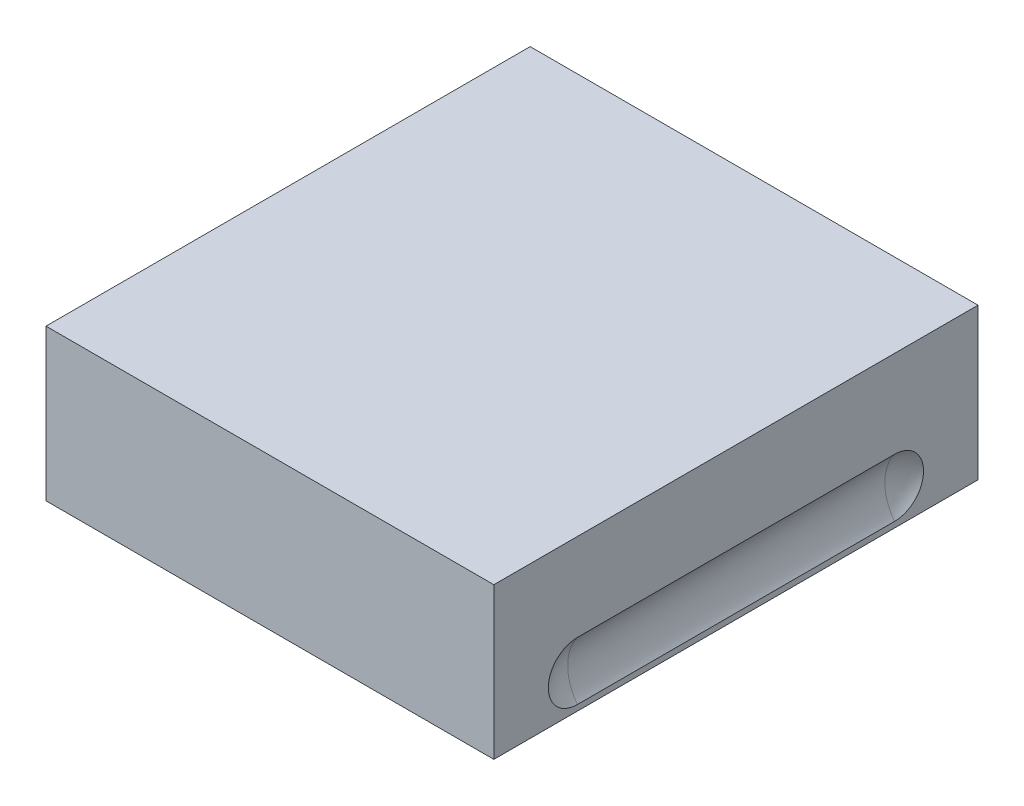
ISO-10303-21;
HEADER;
FILE_DESCRIPTION(('STEP AP214'),'2;1');
FILE_NAME('part.step','',(''),(''),'','','');
FILE_SCHEMA(('AUTOMOTIVE_DESIGN { 1 0 10303 214 1 1 1 1 }'));
ENDSEC;
DATA;
#1=APPLICATION_CONTEXT('core data for automotive mechanical design processes');
#2=APPLICATION_PROTOCOL_DEFINITION('international standard','automotive_design',2000,#1);
#3=PRODUCT_CONTEXT('',#1,'mechanical');
#4=PRODUCT('Part','Part','',(#3));
#5=PRODUCT_RELATED_PRODUCT_CATEGORY('part','',(#4));
#6=PRODUCT_DEFINITION_FORMATION('','',#4);
#7=PRODUCT_DEFINITION_CONTEXT('part definition',#1,'design');
#8=PRODUCT_DEFINITION('design','',#6,#7);
#9=PRODUCT_DEFINITION_SHAPE('','',#8);
#10=(LENGTH_UNIT() NAMED_UNIT(*) SI_UNIT(.MILLI.,.METRE.));
#11=(NAMED_UNIT(*) PLANE_ANGLE_UNIT() SI_UNIT($,.RADIAN.));
#12=(NAMED_UNIT(*) SI_UNIT($,.STERADIAN.) SOLID_ANGLE_UNIT());
#13=UNCERTAINTY_MEASURE_WITH_UNIT(LENGTH_MEASURE(1.E-05),#10,'distance_accuracy_value','');
#14=(GEOMETRIC_REPRESENTATION_CONTEXT(3) GLOBAL_UNCERTAINTY_ASSIGNED_CONTEXT((#13)) GLOBAL_UNIT_ASSIGNED_CONTEXT((#10,
#11,#12)) REPRESENTATION_CONTEXT('',''));
#15=CARTESIAN_POINT('',(0.,0.,0.));
#16=DIRECTION('',(0.,0.,1.));
#17=DIRECTION('',(1.,0.,0.));
#18=AXIS2_PLACEMENT_3D('',#15,#16,#17);
#19=CARTESIAN_POINT('',(0.,82.,-155.));
#20=DIRECTION('',(0.,1.,0.));
#21=DIRECTION('',(0.,0.,1.));
#22=AXIS2_PLACEMENT_3D('',#19,#20,#21);
#23=PLANE('',#22);
#24=DIRECTION('',(1.,0.,0.));
#25=VECTOR('',#24,1.);
#26=CARTESIAN_POINT('',(23.5,82.,-114.));
#27=LINE('',#26,#25);
#28=CARTESIAN_POINT('',(23.5,82.,-114.));
#29=VERTEX_POINT('',#28);
#30=CARTESIAN_POINT('',(-23.5,82.,-114.));
#31=VERTEX_POINT('',#30);
#32=EDGE_CURVE('E272',#29,#31,#27,.F.);
#33=ORIENTED_EDGE('',*,*,#32,.T.);
#34=DIRECTION('',(0.,0.,1.));
#35=VECTOR('',#34,1.);
#36=CARTESIAN_POINT('',(-23.5,82.,-114.));
#37=LINE('',#36,#35);
#38=CARTESIAN_POINT('',(-23.5,82.,-196.));
#39=VERTEX_POINT('',#38);
#40=EDGE_CURVE('E271',#31,#39,#37,.F.);
#41=ORIENTED_EDGE('',*,*,#40,.T.);
#42=DIRECTION('',(-1.,0.,0.));
#43=VECTOR('',#42,1.);
#44=CARTESIAN_POINT('',(-23.5,82.,-196.));
#45=LINE('',#44,#43);
#46=CARTESIAN_POINT('',(23.5,82.,-196.));
#47=VERTEX_POINT('',#46);
#48=EDGE_CURVE('E279',#39,#47,#45,.F.);
#49=ORIENTED_EDGE('',*,*,#48,.T.);
#50=DIRECTION('',(0.,0.,-1.));
#51=VECTOR('',#50,1.);
#52=CARTESIAN_POINT('',(23.5,82.,-196.));
#53=LINE('',#52,#51);
#54=EDGE_CURVE('E80',#47,#29,#53,.F.);
#55=ORIENTED_EDGE('',*,*,#54,.T.);
#56=EDGE_LOOP('',(#33,#41,#49,#55));
#57=FACE_BOUND('',#56,.T.);
#58=ADVANCED_FACE('F14',(#57),#23,.F.);
#59=CARTESIAN_POINT('',(23.5,70.,-114.));
#60=DIRECTION('',(0.,0.,1.));
#61=DIRECTION('',(1.,0.,0.));
#62=AXIS2_PLACEMENT_3D('',#59,#60,#61);
#63=PLANE('',#62);
#64=DIRECTION('',(0.,1.,0.));
#65=VECTOR('',#64,1.);
#66=CARTESIAN_POINT('',(23.5,70.,-114.));
#67=LINE('',#66,#65);
#68=CARTESIAN_POINT('',(23.5,70.,-114.));
#69=VERTEX_POINT('',#68);
#70=EDGE_CURVE('E250',#29,#69,#67,.F.);
#71=ORIENTED_EDGE('',*,*,#70,.T.);
#72=DIRECTION('',(1.,0.,0.));
#73=VECTOR('',#72,1.);
#74=CARTESIAN_POINT('',(0.,70.,-114.));
#75=LINE('',#74,#73);
#76=CARTESIAN_POINT('',(-23.5,70.,-114.));
#77=VERTEX_POINT('',#76);
#78=EDGE_CURVE('E218',#69,#77,#75,.F.);
#79=ORIENTED_EDGE('',*,*,#78,.T.);
#80=DIRECTION('',(0.,1.,0.));
#81=VECTOR('',#80,1.);
#82=CARTESIAN_POINT('',(-23.5,70.,-114.));
#83=LINE('',#82,#81);
#84=EDGE_CURVE('E263',#77,#31,#83,.T.);
#85=ORIENTED_EDGE('',*,*,#84,.T.);
#86=ORIENTED_EDGE('',*,*,#32,.F.);
#87=EDGE_LOOP('',(#71,#79,#85,#86));
#88=FACE_BOUND('',#87,.T.);
#89=ADVANCED_FACE('F260',(#88),#63,.F.);
#90=CARTESIAN_POINT('',(-23.5,70.,-114.));
#91=DIRECTION('',(-1.,0.,0.));
#92=DIRECTION('',(0.,0.,1.));
#93=AXIS2_PLACEMENT_3D('',#90,#91,#92);
#94=PLANE('',#93);
#95=ORIENTED_EDGE('',*,*,#84,.F.);
#96=DIRECTION('',(0.,0.,1.));
#97=VECTOR('',#96,1.);
#98=CARTESIAN_POINT('',(-23.5,70.,-155.));
#99=LINE('',#98,#97);
#100=CARTESIAN_POINT('',(-23.5,70.,-196.));
#101=VERTEX_POINT('',#100);
#102=EDGE_CURVE('E221',#77,#101,#99,.F.);
#103=ORIENTED_EDGE('',*,*,#102,.T.);
#104=DIRECTION('',(0.,1.,0.));
#105=VECTOR('',#104,1.);
#106=CARTESIAN_POINT('',(-23.5,70.,-196.));
#107=LINE('',#106,#105);
#108=EDGE_CURVE('E274',#101,#39,#107,.T.);
#109=ORIENTED_EDGE('',*,*,#108,.T.);
#110=ORIENTED_EDGE('',*,*,#40,.F.);
#111=EDGE_LOOP('',(#95,#103,#109,#110));
#112=FACE_BOUND('',#111,.T.);
#113=ADVANCED_FACE('F268',(#112),#94,.F.);
#114=CARTESIAN_POINT('',(-23.5,70.,-196.));
#115=DIRECTION('',(0.,0.,-1.));
#116=DIRECTION('',(-1.,0.,0.));
#117=AXIS2_PLACEMENT_3D('',#114,#115,#116);
#118=PLANE('',#117);
#119=ORIENTED_EDGE('',*,*,#108,.F.);
#120=DIRECTION('',(1.,0.,0.));
#121=VECTOR('',#120,1.);
#122=CARTESIAN_POINT('',(0.,70.,-196.));
#123=LINE('',#122,#121);
#124=CARTESIAN_POINT('',(23.5,70.,-196.));
#125=VERTEX_POINT('',#124);
#126=EDGE_CURVE('E233',#101,#125,#123,.T.);
#127=ORIENTED_EDGE('',*,*,#126,.T.);
#128=DIRECTION('',(0.,1.,0.));
#129=VECTOR('',#128,1.);
#130=CARTESIAN_POINT('',(23.5,70.,-196.));
#131=LINE('',#130,#129);
#132=EDGE_CURVE('E251',#125,#47,#131,.T.);
#133=ORIENTED_EDGE('',*,*,#132,.T.);
#134=ORIENTED_EDGE('',*,*,#48,.F.);
#135=EDGE_LOOP('',(#119,#127,#133,#134));
#136=FACE_BOUND('',#135,.T.);
#137=ADVANCED_FACE('F288',(#136),#118,.F.);
#138=CARTESIAN_POINT('',(23.5,70.,-196.));
#139=DIRECTION('',(1.,0.,0.));
#140=DIRECTION('',(0.,0.,-1.));
#141=AXIS2_PLACEMENT_3D('',#138,#139,#140);
#142=PLANE('',#141);
#143=ORIENTED_EDGE('',*,*,#132,.F.);
#144=DIRECTION('',(0.,0.,1.));
#145=VECTOR('',#144,1.);
#146=CARTESIAN_POINT('',(23.5,70.,-155.));
#147=LINE('',#146,#145);
#148=EDGE_CURVE('E93',#125,#69,#147,.T.);
#149=ORIENTED_EDGE('',*,*,#148,.T.);
#150=ORIENTED_EDGE('',*,*,#70,.F.);
#151=ORIENTED_EDGE('',*,*,#54,.F.);
#152=EDGE_LOOP('',(#143,#149,#150,#151));
#153=FACE_BOUND('',#152,.T.);
#154=ADVANCED_FACE('F246',(#153),#142,.F.);
#155=CARTESIAN_POINT('',(86.8,81.5,-102.6));
#156=DIRECTION('',(0.319232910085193,0.363109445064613,0.875352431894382));
#157=DIRECTION('',(0.68200630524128,-0.729362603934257,0.053829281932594));
#158=AXIS2_PLACEMENT_3D('',#155,#156,#157);
#159=SPHERICAL_SURFACE('',#158,16.);
#160=CARTESIAN_POINT('',(86.8,81.5,-102.6));
#161=DIRECTION('',(0.,0.,1.));
#162=DIRECTION('',(1.,0.,0.));
#163=AXIS2_PLACEMENT_3D('',#160,#161,#162);
#164=CIRCLE('',#163,16.);
#165=CARTESIAN_POINT('',(74.,71.9,-102.6));
#166=VERTEX_POINT('',#165);
#167=CARTESIAN_POINT('',(74.,91.1,-102.6));
#168=VERTEX_POINT('',#167);
#169=EDGE_CURVE('E18',#166,#168,#164,.F.);
#170=ORIENTED_EDGE('',*,*,#169,.T.);
#171=CARTESIAN_POINT('',(74.,71.9000000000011,-102.6));
#172=CARTESIAN_POINT('',(74.,71.8999709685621,-102.329996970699));
#173=CARTESIAN_POINT('',(74.,71.9113896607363,-102.059998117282));
#174=CARTESIAN_POINT('',(74.,71.9569128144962,-101.52193206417));
#175=CARTESIAN_POINT('',(74.,71.9910161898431,-101.253864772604));
#176=CARTESIAN_POINT('',(74.,72.0816671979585,-100.721746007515));
#177=CARTESIAN_POINT('',(74.,72.1381990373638,-100.457691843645));
#178=CARTESIAN_POINT('',(74.,72.2732956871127,-99.9352849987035));
#179=CARTESIAN_POINT('',(74.,72.35186022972,-99.6769322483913));
#180=CARTESIAN_POINT('',(74.,72.5305080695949,-99.1676431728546));
#181=CARTESIAN_POINT('',(74.,72.6306012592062,-98.9167103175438));
#182=CARTESIAN_POINT('',(74.,72.8515750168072,-98.4241642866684));
#183=CARTESIAN_POINT('',(74.,72.9724560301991,-98.1825513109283));
#184=CARTESIAN_POINT('',(74.,73.2341176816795,-97.7104172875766));
#185=CARTESIAN_POINT('',(74.,73.3748942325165,-97.4798939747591));
#186=CARTESIAN_POINT('',(74.,73.6753642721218,-97.0315258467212));
#187=CARTESIAN_POINT('',(74.,73.8350576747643,-96.8136809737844));
#188=CARTESIAN_POINT('',(74.,74.1722327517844,-96.3922096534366));
#189=CARTESIAN_POINT('',(74.,74.3497150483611,-96.1885837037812));
#190=CARTESIAN_POINT('',(74.,74.7211976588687,-95.7970102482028));
#191=CARTESIAN_POINT('',(74.,74.9151976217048,-95.6090624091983));
#192=CARTESIAN_POINT('',(74.,75.3183728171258,-95.2501469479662));
#193=CARTESIAN_POINT('',(74.,75.5275505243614,-95.0791821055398));
#194=CARTESIAN_POINT('',(74.,75.9595657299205,-94.7554832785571));
#195=CARTESIAN_POINT('',(74.,76.1824032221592,-94.6027492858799));
#196=CARTESIAN_POINT('',(74.,76.6401435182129,-94.31660437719));
#197=CARTESIAN_POINT('',(74.,76.875045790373,-94.1831926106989));
#198=CARTESIAN_POINT('',(74.,77.3552545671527,-93.9366326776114));
#199=CARTESIAN_POINT('',(74.,77.6005610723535,-93.8234845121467));
#200=CARTESIAN_POINT('',(74.,78.0998181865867,-93.6182628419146));
#201=CARTESIAN_POINT('',(74.,78.3537682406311,-93.5261879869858));
#202=CARTESIAN_POINT('',(74.,78.8685220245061,-93.3637582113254));
#203=CARTESIAN_POINT('',(74.,79.1293257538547,-93.2934032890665));
#204=CARTESIAN_POINT('',(74.,79.6559382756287,-93.1749123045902));
#205=CARTESIAN_POINT('',(74.,79.9217471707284,-93.1267766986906));
#206=CARTESIAN_POINT('',(74.,80.4564751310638,-93.0530686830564));
#207=CARTESIAN_POINT('',(74.,80.7253941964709,-93.0274962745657));
#208=CARTESIAN_POINT('',(74.,81.2644368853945,-92.9990961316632));
#209=CARTESIAN_POINT('',(74.,81.5345605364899,-92.9962689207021));
#210=CARTESIAN_POINT('',(74.,82.0740857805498,-93.0133806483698));
#211=CARTESIAN_POINT('',(74.,82.3434873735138,-93.0333195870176));
#212=CARTESIAN_POINT('',(74.,82.8796505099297,-93.0958215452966));
#213=CARTESIAN_POINT('',(74.,83.1464120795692,-93.1383843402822));
#214=CARTESIAN_POINT('',(74.,83.6754013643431,-93.2458312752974));
#215=CARTESIAN_POINT('',(74.,83.9376290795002,-93.3107154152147));
#216=CARTESIAN_POINT('',(74.,84.4556855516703,-93.4623435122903));
#217=CARTESIAN_POINT('',(74.,84.7115143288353,-93.5490874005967));
#218=CARTESIAN_POINT('',(74.,85.214954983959,-93.7438183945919));
#219=CARTESIAN_POINT('',(74.,85.4625668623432,-93.8518054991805));
#220=CARTESIAN_POINT('',(74.,85.947819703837,-94.0882582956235));
#221=CARTESIAN_POINT('',(74.,86.1854604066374,-94.2167245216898));
#222=CARTESIAN_POINT('',(74.,86.6490745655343,-94.4932202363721));
#223=CARTESIAN_POINT('',(74.,86.8750480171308,-94.6412497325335));
#224=CARTESIAN_POINT('',(74.,87.3137102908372,-94.9558118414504));
#225=CARTESIAN_POINT('',(74.,87.5263997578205,-95.1223435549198));
#226=CARTESIAN_POINT('',(74.,87.9369936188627,-95.4727317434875));
#227=CARTESIAN_POINT('',(74.,88.1348980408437,-95.6565881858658));
#228=CARTESIAN_POINT('',(74.,88.5144879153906,-96.0402913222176));
#229=CARTESIAN_POINT('',(74.,88.6961757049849,-96.240135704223));
#230=CARTESIAN_POINT('',(74.,89.0420768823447,-96.6544219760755));
#231=CARTESIAN_POINT('',(74.,89.2062898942,-96.8688641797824));
#232=CARTESIAN_POINT('',(74.,89.5161199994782,-97.3108895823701));
#233=CARTESIAN_POINT('',(74.,89.6617310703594,-97.5384770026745));
#234=CARTESIAN_POINT('',(74.,89.9332554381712,-98.0051042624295));
#235=CARTESIAN_POINT('',(74.,90.0591693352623,-98.2441437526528));
#236=CARTESIAN_POINT('',(74.,90.2904830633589,-98.7321367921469));
#237=CARTESIAN_POINT('',(74.,90.3958697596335,-98.9810965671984));
#238=CARTESIAN_POINT('',(74.,90.585276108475,-99.4870096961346));
#239=CARTESIAN_POINT('',(74.,90.6692963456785,-99.7439628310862));
#240=CARTESIAN_POINT('',(74.,90.8152815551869,-100.263698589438));
#241=CARTESIAN_POINT('',(74.,90.8772745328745,-100.526473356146));
#242=CARTESIAN_POINT('',(74.,90.9788912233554,-101.056205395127));
#243=CARTESIAN_POINT('',(74.,91.0185259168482,-101.323160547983));
#244=CARTESIAN_POINT('',(74.,91.0645706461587,-101.758913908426));
#245=CARTESIAN_POINT('',(74.,91.0778651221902,-101.927014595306));
#246=CARTESIAN_POINT('',(74.,91.0955734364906,-102.263404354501));
#247=CARTESIAN_POINT('',(74.,91.100001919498,-102.43169265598));
#248=CARTESIAN_POINT('',(74.,91.0999999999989,-102.6));
#249=B_SPLINE_CURVE_WITH_KNOTS('',3,(#171,#172,#173,#174,#175,#176,#177,#178,#179,#180,#181,
#182,#183,#184,#185,#186,#187,#188,#189,#190,#191,#192,#193,#194,#195,#196,#197,#198,#199,#200,
#201,#202,#203,#204,#205,#206,#207,#208,#209,#210,#211,#212,#213,#214,#215,#216,#217,#218,#219,
#220,#221,#222,#223,#224,#225,#226,#227,#228,#229,#230,#231,#232,#233,#234,#235,#236,#237,#238,
#239,#240,#241,#242,#243,#244,#245,#246,#247,#248),.UNSPECIFIED.,.F.,.F.,(4,2,2,2,2,2,2,2,2,2,2,
2,2,2,2,2,2,2,2,2,2,2,2,2,2,2,2,2,2,2,2,2,2,2,2,2,2,2,4),(0.,0.809761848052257,1.61948492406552,
2.42863882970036,3.23778290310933,4.04729957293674,4.85683358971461,5.66620154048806,
6.47556580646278,7.28495839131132,8.09433377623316,8.90384142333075,9.71334870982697,
10.5228203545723,11.3322920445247,12.1417118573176,12.9511316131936,13.7605679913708,
14.5700044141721,15.3794594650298,16.188914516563,16.9983615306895,17.8078085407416,
18.6172530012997,19.4266974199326,20.2361629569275,21.0456288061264,21.8550553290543,
22.6644803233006,23.4737884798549,24.2831140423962,25.0927009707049,25.902263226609,
26.7123418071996,27.5223982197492,28.3314210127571,29.1400461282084,29.6457079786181,
30.1505338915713),.UNSPECIFIED.);
#250=EDGE_CURVE('E77',#166,#168,#249,.T.);
#251=ORIENTED_EDGE('',*,*,#250,.F.);
#252=EDGE_LOOP('',(#170,#251));
#253=FACE_BOUND('',#252,.T.);
#254=ADVANCED_FACE('F75',(#253),#159,.F.);
#255=CARTESIAN_POINT('',(86.8,81.5,-155.));
#256=DIRECTION('',(0.,0.,1.));
#257=DIRECTION('',(1.,0.,0.));
#258=AXIS2_PLACEMENT_3D('',#255,#256,#257);
#259=CYLINDRICAL_SURFACE('',#258,16.);
#260=ORIENTED_EDGE('',*,*,#169,.F.);
#261=DIRECTION('',(0.,0.,-1.));
#262=VECTOR('',#261,1.);
#263=CARTESIAN_POINT('',(74.,71.9,-235.));
#264=LINE('',#263,#262);
#265=CARTESIAN_POINT('',(74.,71.9,-207.4));
#266=VERTEX_POINT('',#265);
#267=EDGE_CURVE('E91',#266,#166,#264,.F.);
#268=ORIENTED_EDGE('',*,*,#267,.F.);
#269=CARTESIAN_POINT('',(86.8,81.5,-207.4));
#270=DIRECTION('',(0.,0.,1.));
#271=DIRECTION('',(1.,0.,0.));
#272=AXIS2_PLACEMENT_3D('',#269,#270,#271);
#273=CIRCLE('',#272,16.);
#274=CARTESIAN_POINT('',(74.,91.1,-207.4));
#275=VERTEX_POINT('',#274);
#276=EDGE_CURVE('E79',#266,#275,#273,.F.);
#277=ORIENTED_EDGE('',*,*,#276,.T.);
#278=DIRECTION('',(0.,0.,-1.));
#279=VECTOR('',#278,1.);
#280=CARTESIAN_POINT('',(74.,91.1,-235.));
#281=LINE('',#280,#279);
#282=EDGE_CURVE('E82',#168,#275,#281,.T.);
#283=ORIENTED_EDGE('',*,*,#282,.F.);
#284=EDGE_LOOP('',(#260,#268,#277,#283));
#285=FACE_BOUND('',#284,.T.);
#286=ADVANCED_FACE('F83',(#285),#259,.F.);
#287=CARTESIAN_POINT('',(86.8,81.5,-207.4));
#288=DIRECTION('',(0.319232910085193,0.363109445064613,0.875352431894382));
#289=DIRECTION('',(0.68200630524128,-0.729362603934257,0.053829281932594));
#290=AXIS2_PLACEMENT_3D('',#287,#288,#289);
#291=SPHERICAL_SURFACE('',#290,16.);
#292=ORIENTED_EDGE('',*,*,#276,.F.);
#293=CARTESIAN_POINT('',(74.,91.0999999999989,-207.4));
#294=CARTESIAN_POINT('',(74.,91.1000290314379,-207.670003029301));
#295=CARTESIAN_POINT('',(74.,91.0886103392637,-207.940001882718));
#296=CARTESIAN_POINT('',(74.,91.0430871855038,-208.47806793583));
#297=CARTESIAN_POINT('',(74.,91.0089838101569,-208.746135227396));
#298=CARTESIAN_POINT('',(74.,90.9183328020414,-209.278253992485));
#299=CARTESIAN_POINT('',(74.,90.8618009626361,-209.542308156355));
#300=CARTESIAN_POINT('',(74.,90.7267043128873,-210.064715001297));
#301=CARTESIAN_POINT('',(74.,90.64813977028,-210.323067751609));
#302=CARTESIAN_POINT('',(74.,90.4694919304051,-210.832356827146));
#303=CARTESIAN_POINT('',(74.,90.3693987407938,-211.083289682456));
#304=CARTESIAN_POINT('',(74.,90.1484249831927,-211.575835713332));
#305=CARTESIAN_POINT('',(74.,90.0275439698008,-211.817448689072));
#306=CARTESIAN_POINT('',(74.,89.7658823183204,-212.289582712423));
#307=CARTESIAN_POINT('',(74.,89.6251057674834,-212.520106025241));
#308=CARTESIAN_POINT('',(74.,89.3246357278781,-212.968474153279));
#309=CARTESIAN_POINT('',(74.,89.1649423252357,-213.186319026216));
#310=CARTESIAN_POINT('',(74.,88.8277672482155,-213.607790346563));
#311=CARTESIAN_POINT('',(74.,88.6502849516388,-213.811416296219));
#312=CARTESIAN_POINT('',(74.,88.2788023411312,-214.202989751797));
#313=CARTESIAN_POINT('',(74.,88.0848023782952,-214.390937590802));
#314=CARTESIAN_POINT('',(74.,87.6816271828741,-214.749853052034));
#315=CARTESIAN_POINT('',(74.,87.4724494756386,-214.92081789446));
#316=CARTESIAN_POINT('',(74.,87.0404342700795,-215.244516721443));
#317=CARTESIAN_POINT('',(74.,86.8175967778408,-215.39725071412));
#318=CARTESIAN_POINT('',(74.,86.3598564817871,-215.68339562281));
#319=CARTESIAN_POINT('',(74.,86.124954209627,-215.816807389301));
#320=CARTESIAN_POINT('',(74.,85.6447454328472,-216.063367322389));
#321=CARTESIAN_POINT('',(74.,85.3994389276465,-216.176515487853));
#322=CARTESIAN_POINT('',(74.,84.9001818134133,-216.381737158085));
#323=CARTESIAN_POINT('',(74.,84.6462317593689,-216.473812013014));
#324=CARTESIAN_POINT('',(74.,84.1314779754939,-216.636241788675));
#325=CARTESIAN_POINT('',(74.,83.8706742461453,-216.706596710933));
#326=CARTESIAN_POINT('',(74.,83.3440617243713,-216.82508769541));
#327=CARTESIAN_POINT('',(74.,83.0782528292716,-216.873223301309));
#328=CARTESIAN_POINT('',(74.,82.5435248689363,-216.946931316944));
#329=CARTESIAN_POINT('',(74.,82.2746058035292,-216.972503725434));
#330=CARTESIAN_POINT('',(74.,81.7355631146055,-217.000903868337));
#331=CARTESIAN_POINT('',(74.,81.4654394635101,-217.003731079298));
#332=CARTESIAN_POINT('',(74.,80.9259142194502,-216.98661935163));
#333=CARTESIAN_POINT('',(74.,80.6565126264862,-216.966680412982));
#334=CARTESIAN_POINT('',(74.,80.1203494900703,-216.904178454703));
#335=CARTESIAN_POINT('',(74.,79.8535879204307,-216.861615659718));
#336=CARTESIAN_POINT('',(74.,79.3245986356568,-216.754168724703));
#337=CARTESIAN_POINT('',(74.,79.0623709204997,-216.689284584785));
#338=CARTESIAN_POINT('',(74.,78.5443144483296,-216.53765648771));
#339=CARTESIAN_POINT('',(74.,78.2884856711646,-216.450912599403));
#340=CARTESIAN_POINT('',(74.,77.785045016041,-216.256181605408));
#341=CARTESIAN_POINT('',(74.,77.5374331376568,-216.148194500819));
#342=CARTESIAN_POINT('',(74.,77.052180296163,-215.911741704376));
#343=CARTESIAN_POINT('',(74.,76.8145395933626,-215.78327547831));
#344=CARTESIAN_POINT('',(74.,76.3509254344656,-215.506779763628));
#345=CARTESIAN_POINT('',(74.,76.1249519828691,-215.358750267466));
#346=CARTESIAN_POINT('',(74.,75.6862897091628,-215.04418815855));
#347=CARTESIAN_POINT('',(74.,75.4736002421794,-214.87765644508));
#348=CARTESIAN_POINT('',(74.,75.0630063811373,-214.527268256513));
#349=CARTESIAN_POINT('',(74.,74.8651019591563,-214.343411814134));
#350=CARTESIAN_POINT('',(74.,74.4855120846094,-213.959708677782));
#351=CARTESIAN_POINT('',(74.,74.3038242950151,-213.759864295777));
#352=CARTESIAN_POINT('',(74.,73.9579231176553,-213.345578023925));
#353=CARTESIAN_POINT('',(74.,73.7937101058,-213.131135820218));
#354=CARTESIAN_POINT('',(74.,73.4838800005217,-212.68911041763));
#355=CARTESIAN_POINT('',(74.,73.3382689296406,-212.461522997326));
#356=CARTESIAN_POINT('',(74.,73.0667445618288,-211.994895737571));
#357=CARTESIAN_POINT('',(74.,72.9408306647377,-211.755856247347));
#358=CARTESIAN_POINT('',(74.,72.709516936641,-211.267863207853));
#359=CARTESIAN_POINT('',(74.,72.6041302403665,-211.018903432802));
#360=CARTESIAN_POINT('',(74.,72.414723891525,-210.512990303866));
#361=CARTESIAN_POINT('',(74.,72.3307036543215,-210.256037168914));
#362=CARTESIAN_POINT('',(74.,72.1847184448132,-209.736301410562));
#363=CARTESIAN_POINT('',(74.,72.1227254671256,-209.473526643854));
#364=CARTESIAN_POINT('',(74.,72.0211087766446,-208.943794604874));
#365=CARTESIAN_POINT('',(74.,71.9814740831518,-208.676839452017));
#366=CARTESIAN_POINT('',(74.,71.9354293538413,-208.241086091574));
#367=CARTESIAN_POINT('',(74.,71.9221348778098,-208.072985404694));
#368=CARTESIAN_POINT('',(74.,71.9044265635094,-207.736595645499));
#369=CARTESIAN_POINT('',(74.,71.899998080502,-207.56830734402));
#370=CARTESIAN_POINT('',(74.,71.9000000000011,-207.4));
#371=B_SPLINE_CURVE_WITH_KNOTS('',3,(#293,#294,#295,#296,#297,#298,#299,#300,#301,#302,#303,
#304,#305,#306,#307,#308,#309,#310,#311,#312,#313,#314,#315,#316,#317,#318,#319,#320,#321,#322,
#323,#324,#325,#326,#327,#328,#329,#330,#331,#332,#333,#334,#335,#336,#337,#338,#339,#340,#341,
#342,#343,#344,#345,#346,#347,#348,#349,#350,#351,#352,#353,#354,#355,#356,#357,#358,#359,#360,
#361,#362,#363,#364,#365,#366,#367,#368,#369,#370),.UNSPECIFIED.,.F.,.F.,(4,2,2,2,2,2,2,2,2,2,2,
2,2,2,2,2,2,2,2,2,2,2,2,2,2,2,2,2,2,2,2,2,2,2,2,2,2,2,4),(0.,0.809761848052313,1.61948492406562,
2.42863882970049,3.23778290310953,4.04729957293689,4.85683358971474,5.66620154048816,
6.47556580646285,7.2849583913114,8.09433377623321,8.90384142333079,9.71334870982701,
10.5228203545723,11.3322920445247,12.1417118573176,12.9511316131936,13.7605679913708,
14.570004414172,15.3794594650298,16.188914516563,16.9983615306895,17.8078085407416,
18.6172530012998,19.4266974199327,20.2361629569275,21.0456288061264,21.8550553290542,
22.6644803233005,23.4737884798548,24.2831140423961,25.0927009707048,25.9022632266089,
26.7123418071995,27.5223982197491,28.331421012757,29.1400461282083,29.645707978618,
30.1505338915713),.UNSPECIFIED.);
#372=EDGE_CURVE('E88',#275,#266,#371,.T.);
#373=ORIENTED_EDGE('',*,*,#372,.F.);
#374=EDGE_LOOP('',(#292,#373));
#375=FACE_BOUND('',#374,.T.);
#376=ADVANCED_FACE('F154',(#375),#291,.F.);
#377=CARTESIAN_POINT('',(-86.8,81.5,-207.4));
#378=DIRECTION('',(0.319232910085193,0.363109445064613,0.875352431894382));
#379=DIRECTION('',(0.68200630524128,-0.729362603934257,0.053829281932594));
#380=AXIS2_PLACEMENT_3D('',#377,#378,#379);
#381=SPHERICAL_SURFACE('',#380,16.);
#382=CARTESIAN_POINT('',(-86.8,81.5,-207.4));
#383=DIRECTION('',(0.,0.,-1.));
#384=DIRECTION('',(-1.,0.,0.));
#385=AXIS2_PLACEMENT_3D('',#382,#383,#384);
#386=CIRCLE('',#385,16.);
#387=CARTESIAN_POINT('',(-74.,71.9,-207.4));
#388=VERTEX_POINT('',#387);
#389=CARTESIAN_POINT('',(-74.,91.1,-207.4));
#390=VERTEX_POINT('',#389);
#391=EDGE_CURVE('E219',#388,#390,#386,.F.);
#392=ORIENTED_EDGE('',*,*,#391,.T.);
#393=CARTESIAN_POINT('',(-74.,71.9000000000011,-207.4));
#394=CARTESIAN_POINT('',(-74.,71.8999709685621,-207.670003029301));
#395=CARTESIAN_POINT('',(-74.,71.9113896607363,-207.940001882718));
#396=CARTESIAN_POINT('',(-74.,71.9569128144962,-208.47806793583));
#397=CARTESIAN_POINT('',(-74.,71.9910161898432,-208.746135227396));
#398=CARTESIAN_POINT('',(-74.,72.0816671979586,-209.278253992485));
#399=CARTESIAN_POINT('',(-74.,72.1381990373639,-209.542308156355));
#400=CARTESIAN_POINT('',(-74.,72.2732956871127,-210.064715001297));
#401=CARTESIAN_POINT('',(-74.,72.35186022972,-210.323067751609));
#402=CARTESIAN_POINT('',(-74.,72.5305080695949,-210.832356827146));
#403=CARTESIAN_POINT('',(-74.,72.6306012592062,-211.083289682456));
#404=CARTESIAN_POINT('',(-74.,72.8515750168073,-211.575835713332));
#405=CARTESIAN_POINT('',(-74.,72.9724560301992,-211.817448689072));
#406=CARTESIAN_POINT('',(-74.,73.2341176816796,-212.289582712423));
#407=CARTESIAN_POINT('',(-74.,73.3748942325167,-212.520106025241));
#408=CARTESIAN_POINT('',(-74.,73.6753642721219,-212.968474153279));
#409=CARTESIAN_POINT('',(-74.,73.8350576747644,-213.186319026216));
#410=CARTESIAN_POINT('',(-74.,74.1722327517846,-213.607790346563));
#411=CARTESIAN_POINT('',(-74.,74.3497150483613,-213.811416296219));
#412=CARTESIAN_POINT('',(-74.,74.7211976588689,-214.202989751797));
#413=CARTESIAN_POINT('',(-74.,74.9151976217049,-214.390937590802));
#414=CARTESIAN_POINT('',(-74.,75.318372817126,-214.749853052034));
#415=CARTESIAN_POINT('',(-74.,75.5275505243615,-214.92081789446));
#416=CARTESIAN_POINT('',(-74.,75.9595657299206,-215.244516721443));
#417=CARTESIAN_POINT('',(-74.,76.1824032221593,-215.39725071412));
#418=CARTESIAN_POINT('',(-74.,76.640143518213,-215.68339562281));
#419=CARTESIAN_POINT('',(-74.,76.8750457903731,-215.816807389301));
#420=CARTESIAN_POINT('',(-74.,77.3552545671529,-216.063367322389));
#421=CARTESIAN_POINT('',(-74.,77.6005610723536,-216.176515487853));
#422=CARTESIAN_POINT('',(-74.,78.0998181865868,-216.381737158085));
#423=CARTESIAN_POINT('',(-74.,78.3537682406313,-216.473812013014));
#424=CARTESIAN_POINT('',(-74.,78.8685220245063,-216.636241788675));
#425=CARTESIAN_POINT('',(-74.,79.1293257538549,-216.706596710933));
#426=CARTESIAN_POINT('',(-74.,79.6559382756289,-216.82508769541));
#427=CARTESIAN_POINT('',(-74.,79.9217471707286,-216.873223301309));
#428=CARTESIAN_POINT('',(-74.,80.4564751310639,-216.946931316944));
#429=CARTESIAN_POINT('',(-74.,80.725394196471,-216.972503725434));
#430=CARTESIAN_POINT('',(-74.,81.2644368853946,-217.000903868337));
#431=CARTESIAN_POINT('',(-74.,81.5345605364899,-217.003731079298));
#432=CARTESIAN_POINT('',(-74.,82.0740857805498,-216.98661935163));
#433=CARTESIAN_POINT('',(-74.,82.3434873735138,-216.966680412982));
#434=CARTESIAN_POINT('',(-74.,82.8796505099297,-216.904178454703));
#435=CARTESIAN_POINT('',(-74.,83.1464120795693,-216.861615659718));
#436=CARTESIAN_POINT('',(-74.,83.6754013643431,-216.754168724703));
#437=CARTESIAN_POINT('',(-74.,83.9376290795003,-216.689284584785));
#438=CARTESIAN_POINT('',(-74.,84.4556855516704,-216.53765648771));
#439=CARTESIAN_POINT('',(-74.,84.7115143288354,-216.450912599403));
#440=CARTESIAN_POINT('',(-74.,85.214954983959,-216.256181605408));
#441=CARTESIAN_POINT('',(-74.,85.4625668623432,-216.148194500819));
#442=CARTESIAN_POINT('',(-74.,85.947819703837,-215.911741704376));
#443=CARTESIAN_POINT('',(-74.,86.1854604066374,-215.78327547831));
#444=CARTESIAN_POINT('',(-74.,86.6490745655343,-215.506779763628));
#445=CARTESIAN_POINT('',(-74.,86.8750480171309,-215.358750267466));
#446=CARTESIAN_POINT('',(-74.,87.3137102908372,-215.04418815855));
#447=CARTESIAN_POINT('',(-74.,87.5263997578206,-214.87765644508));
#448=CARTESIAN_POINT('',(-74.,87.9369936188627,-214.527268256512));
#449=CARTESIAN_POINT('',(-74.,88.1348980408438,-214.343411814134));
#450=CARTESIAN_POINT('',(-74.,88.5144879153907,-213.959708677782));
#451=CARTESIAN_POINT('',(-74.,88.6961757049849,-213.759864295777));
#452=CARTESIAN_POINT('',(-74.,89.0420768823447,-213.345578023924));
#453=CARTESIAN_POINT('',(-74.,89.2062898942,-213.131135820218));
#454=CARTESIAN_POINT('',(-74.,89.5161199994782,-212.68911041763));
#455=CARTESIAN_POINT('',(-74.,89.6617310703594,-212.461522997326));
#456=CARTESIAN_POINT('',(-74.,89.9332554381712,-211.994895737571));
#457=CARTESIAN_POINT('',(-74.,90.0591693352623,-211.755856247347));
#458=CARTESIAN_POINT('',(-74.,90.2904830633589,-211.267863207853));
#459=CARTESIAN_POINT('',(-74.,90.3958697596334,-211.018903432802));
#460=CARTESIAN_POINT('',(-74.,90.5852761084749,-210.512990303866));
#461=CARTESIAN_POINT('',(-74.,90.6692963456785,-210.256037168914));
#462=CARTESIAN_POINT('',(-74.,90.8152815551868,-209.736301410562));
#463=CARTESIAN_POINT('',(-74.,90.8772745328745,-209.473526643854));
#464=CARTESIAN_POINT('',(-74.,90.9788912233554,-208.943794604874));
#465=CARTESIAN_POINT('',(-74.,91.0185259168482,-208.676839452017));
#466=CARTESIAN_POINT('',(-74.,91.0645706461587,-208.241086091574));
#467=CARTESIAN_POINT('',(-74.,91.0778651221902,-208.072985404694));
#468=CARTESIAN_POINT('',(-74.,91.0955734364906,-207.736595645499));
#469=CARTESIAN_POINT('',(-74.,91.100001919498,-207.56830734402));
#470=CARTESIAN_POINT('',(-74.,91.0999999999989,-207.4));
#471=B_SPLINE_CURVE_WITH_KNOTS('',3,(#393,#394,#395,#396,#397,#398,#399,#400,#401,#402,#403,
#404,#405,#406,#407,#408,#409,#410,#411,#412,#413,#414,#415,#416,#417,#418,#419,#420,#421,#422,
#423,#424,#425,#426,#427,#428,#429,#430,#431,#432,#433,#434,#435,#436,#437,#438,#439,#440,#441,
#442,#443,#444,#445,#446,#447,#448,#449,#450,#451,#452,#453,#454,#455,#456,#457,#458,#459,#460,
#461,#462,#463,#464,#465,#466,#467,#468,#469,#470),.UNSPECIFIED.,.F.,.F.,(4,2,2,2,2,2,2,2,2,2,2,
2,2,2,2,2,2,2,2,2,2,2,2,2,2,2,2,2,2,2,2,2,2,2,2,2,2,2,4),(0.,0.809761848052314,1.61948492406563,
2.42863882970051,3.23778290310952,4.04729957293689,4.85683358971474,5.66620154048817,
6.47556580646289,7.28495839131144,8.09433377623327,8.90384142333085,9.71334870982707,
10.5228203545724,11.3322920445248,12.1417118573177,12.9511316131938,13.7605679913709,
14.5700044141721,15.3794594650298,16.1889145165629,16.9983615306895,17.8078085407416,
18.6172530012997,19.4266974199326,20.2361629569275,21.0456288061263,21.8550553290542,
22.6644803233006,23.4737884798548,24.2831140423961,25.0927009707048,25.9022632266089,
26.7123418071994,27.522398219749,28.331421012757,29.1400461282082,29.6457079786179,
30.1505338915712),.UNSPECIFIED.);
#472=EDGE_CURVE('E139',#388,#390,#471,.T.);
#473=ORIENTED_EDGE('',*,*,#472,.F.);
#474=EDGE_LOOP('',(#392,#473));
#475=FACE_BOUND('',#474,.T.);
#476=ADVANCED_FACE('F148',(#475),#381,.F.);
#477=CARTESIAN_POINT('',(-86.8,81.5,-155.));
#478=DIRECTION('',(0.,0.,-1.));
#479=DIRECTION('',(-1.,0.,0.));
#480=AXIS2_PLACEMENT_3D('',#477,#478,#479);
#481=CYLINDRICAL_SURFACE('',#480,16.);
#482=ORIENTED_EDGE('',*,*,#391,.F.);
#483=DIRECTION('',(0.,0.,1.));
#484=VECTOR('',#483,1.);
#485=CARTESIAN_POINT('',(-74.,71.9,-75.));
#486=LINE('',#485,#484);
#487=CARTESIAN_POINT('',(-74.,71.9,-102.6));
#488=VERTEX_POINT('',#487);
#489=EDGE_CURVE('E147',#488,#388,#486,.F.);
#490=ORIENTED_EDGE('',*,*,#489,.F.);
#491=CARTESIAN_POINT('',(-86.8,81.5,-102.6));
#492=DIRECTION('',(0.,0.,-1.));
#493=DIRECTION('',(-1.,0.,0.));
#494=AXIS2_PLACEMENT_3D('',#491,#492,#493);
#495=CIRCLE('',#494,16.);
#496=CARTESIAN_POINT('',(-74.,91.1,-102.6));
#497=VERTEX_POINT('',#496);
#498=EDGE_CURVE('E109',#488,#497,#495,.F.);
#499=ORIENTED_EDGE('',*,*,#498,.T.);
#500=DIRECTION('',(0.,0.,1.));
#501=VECTOR('',#500,1.);
#502=CARTESIAN_POINT('',(-74.,91.1,-75.));
#503=LINE('',#502,#501);
#504=EDGE_CURVE('E146',#390,#497,#503,.T.);
#505=ORIENTED_EDGE('',*,*,#504,.F.);
#506=EDGE_LOOP('',(#482,#490,#499,#505));
#507=FACE_BOUND('',#506,.T.);
#508=ADVANCED_FACE('F153',(#507),#481,.F.);
#509=CARTESIAN_POINT('',(-86.8,81.5,-102.6));
#510=DIRECTION('',(0.319232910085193,0.363109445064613,0.875352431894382));
#511=DIRECTION('',(0.68200630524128,-0.729362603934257,0.053829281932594));
#512=AXIS2_PLACEMENT_3D('',#509,#510,#511);
#513=SPHERICAL_SURFACE('',#512,16.);
#514=ORIENTED_EDGE('',*,*,#498,.F.);
#515=CARTESIAN_POINT('',(-74.,91.0999999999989,-102.6));
#516=CARTESIAN_POINT('',(-74.,91.1000290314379,-102.329996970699));
#517=CARTESIAN_POINT('',(-74.,91.0886103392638,-102.059998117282));
#518=CARTESIAN_POINT('',(-74.,91.0430871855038,-101.52193206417));
#519=CARTESIAN_POINT('',(-74.,91.0089838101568,-101.253864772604));
#520=CARTESIAN_POINT('',(-74.,90.9183328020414,-100.721746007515));
#521=CARTESIAN_POINT('',(-74.,90.8618009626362,-100.457691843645));
#522=CARTESIAN_POINT('',(-74.,90.7267043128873,-99.9352849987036));
#523=CARTESIAN_POINT('',(-74.,90.64813977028,-99.6769322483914));
#524=CARTESIAN_POINT('',(-74.,90.4694919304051,-99.1676431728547));
#525=CARTESIAN_POINT('',(-74.,90.3693987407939,-98.9167103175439));
#526=CARTESIAN_POINT('',(-74.,90.1484249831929,-98.4241642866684));
#527=CARTESIAN_POINT('',(-74.,90.027543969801,-98.1825513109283));
#528=CARTESIAN_POINT('',(-74.,89.7658823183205,-97.7104172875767));
#529=CARTESIAN_POINT('',(-74.,89.6251057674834,-97.4798939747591));
#530=CARTESIAN_POINT('',(-74.,89.3246357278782,-97.0315258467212));
#531=CARTESIAN_POINT('',(-74.,89.1649423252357,-96.8136809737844));
#532=CARTESIAN_POINT('',(-74.,88.8277672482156,-96.3922096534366));
#533=CARTESIAN_POINT('',(-74.,88.6502849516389,-96.1885837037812));
#534=CARTESIAN_POINT('',(-74.,88.2788023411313,-95.7970102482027));
#535=CARTESIAN_POINT('',(-74.,88.0848023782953,-95.6090624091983));
#536=CARTESIAN_POINT('',(-74.,87.6816271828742,-95.2501469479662));
#537=CARTESIAN_POINT('',(-74.,87.4724494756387,-95.0791821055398));
#538=CARTESIAN_POINT('',(-74.,87.0404342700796,-94.7554832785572));
#539=CARTESIAN_POINT('',(-74.,86.8175967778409,-94.6027492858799));
#540=CARTESIAN_POINT('',(-74.,86.3598564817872,-94.31660437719));
#541=CARTESIAN_POINT('',(-74.,86.1249542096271,-94.1831926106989));
#542=CARTESIAN_POINT('',(-74.,85.6447454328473,-93.9366326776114));
#543=CARTESIAN_POINT('',(-74.,85.3994389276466,-93.8234845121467));
#544=CARTESIAN_POINT('',(-74.,84.9001818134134,-93.6182628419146));
#545=CARTESIAN_POINT('',(-74.,84.6462317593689,-93.5261879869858));
#546=CARTESIAN_POINT('',(-74.,84.1314779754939,-93.3637582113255));
#547=CARTESIAN_POINT('',(-74.,83.8706742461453,-93.2934032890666));
#548=CARTESIAN_POINT('',(-74.,83.3440617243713,-93.1749123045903));
#549=CARTESIAN_POINT('',(-74.,83.0782528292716,-93.1267766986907));
#550=CARTESIAN_POINT('',(-74.,82.5435248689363,-93.0530686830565));
#551=CARTESIAN_POINT('',(-74.,82.2746058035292,-93.0274962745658));
#552=CARTESIAN_POINT('',(-74.,81.7355631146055,-92.9990961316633));
#553=CARTESIAN_POINT('',(-74.,81.4654394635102,-92.9962689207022));
#554=CARTESIAN_POINT('',(-74.,80.9259142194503,-93.0133806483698));
#555=CARTESIAN_POINT('',(-74.,80.6565126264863,-93.0333195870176));
#556=CARTESIAN_POINT('',(-74.,80.1203494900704,-93.0958215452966));
#557=CARTESIAN_POINT('',(-74.,79.8535879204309,-93.1383843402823));
#558=CARTESIAN_POINT('',(-74.,79.324598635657,-93.2458312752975));
#559=CARTESIAN_POINT('',(-74.,79.0623709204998,-93.3107154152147));
#560=CARTESIAN_POINT('',(-74.,78.5443144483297,-93.4623435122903));
#561=CARTESIAN_POINT('',(-74.,78.2884856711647,-93.5490874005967));
#562=CARTESIAN_POINT('',(-74.,77.785045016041,-93.7438183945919));
#563=CARTESIAN_POINT('',(-74.,77.5374331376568,-93.8518054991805));
#564=CARTESIAN_POINT('',(-74.,77.052180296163,-94.0882582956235));
#565=CARTESIAN_POINT('',(-74.,76.8145395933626,-94.2167245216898));
#566=CARTESIAN_POINT('',(-74.,76.3509254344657,-94.4932202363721));
#567=CARTESIAN_POINT('',(-74.,76.1249519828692,-94.6412497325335));
#568=CARTESIAN_POINT('',(-74.,75.6862897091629,-94.9558118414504));
#569=CARTESIAN_POINT('',(-74.,75.4736002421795,-95.1223435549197));
#570=CARTESIAN_POINT('',(-74.,75.0630063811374,-95.4727317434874));
#571=CARTESIAN_POINT('',(-74.,74.8651019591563,-95.6565881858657));
#572=CARTESIAN_POINT('',(-74.,74.4855120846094,-96.0402913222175));
#573=CARTESIAN_POINT('',(-74.,74.3038242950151,-96.2401357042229));
#574=CARTESIAN_POINT('',(-74.,73.9579231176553,-96.6544219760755));
#575=CARTESIAN_POINT('',(-74.,73.7937101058,-96.8688641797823));
#576=CARTESIAN_POINT('',(-74.,73.4838800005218,-97.31088958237));
#577=CARTESIAN_POINT('',(-74.,73.3382689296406,-97.5384770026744));
#578=CARTESIAN_POINT('',(-74.,73.0667445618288,-98.0051042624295));
#579=CARTESIAN_POINT('',(-74.,72.9408306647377,-98.2441437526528));
#580=CARTESIAN_POINT('',(-74.,72.709516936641,-98.7321367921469));
#581=CARTESIAN_POINT('',(-74.,72.6041302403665,-98.9810965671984));
#582=CARTESIAN_POINT('',(-74.,72.4147238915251,-99.4870096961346));
#583=CARTESIAN_POINT('',(-74.,72.3307036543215,-99.7439628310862));
#584=CARTESIAN_POINT('',(-74.,72.1847184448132,-100.263698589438));
#585=CARTESIAN_POINT('',(-74.,72.1227254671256,-100.526473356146));
#586=CARTESIAN_POINT('',(-74.,72.0211087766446,-101.056205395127));
#587=CARTESIAN_POINT('',(-74.,71.9814740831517,-101.323160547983));
#588=CARTESIAN_POINT('',(-74.,71.9354293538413,-101.758913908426));
#589=CARTESIAN_POINT('',(-74.,71.9221348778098,-101.927014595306));
#590=CARTESIAN_POINT('',(-74.,71.9044265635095,-102.263404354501));
#591=CARTESIAN_POINT('',(-74.,71.899998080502,-102.43169265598));
#592=CARTESIAN_POINT('',(-74.,71.9000000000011,-102.6));
#593=B_SPLINE_CURVE_WITH_KNOTS('',3,(#515,#516,#517,#518,#519,#520,#521,#522,#523,#524,#525,
#526,#527,#528,#529,#530,#531,#532,#533,#534,#535,#536,#537,#538,#539,#540,#541,#542,#543,#544,
#545,#546,#547,#548,#549,#550,#551,#552,#553,#554,#555,#556,#557,#558,#559,#560,#561,#562,#563,
#564,#565,#566,#567,#568,#569,#570,#571,#572,#573,#574,#575,#576,#577,#578,#579,#580,#581,#582,
#583,#584,#585,#586,#587,#588,#589,#590,#591,#592),.UNSPECIFIED.,.F.,.F.,(4,2,2,2,2,2,2,2,2,2,2,
2,2,2,2,2,2,2,2,2,2,2,2,2,2,2,2,2,2,2,2,2,2,2,2,2,2,2,4),(0.,0.809761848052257,1.61948492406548,
2.42863882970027,3.23778290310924,4.04729957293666,4.85683358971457,5.66620154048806,
6.47556580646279,7.28495839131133,8.09433377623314,8.90384142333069,9.71334870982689,
10.5228203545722,11.3322920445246,12.1417118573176,12.9511316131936,13.7605679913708,
14.570004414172,15.3794594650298,16.1889145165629,16.9983615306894,17.8078085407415,
18.6172530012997,19.4266974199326,20.2361629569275,21.0456288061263,21.8550553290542,
22.6644803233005,23.4737884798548,24.2831140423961,25.0927009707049,25.902263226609,
26.7123418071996,27.5223982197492,28.3314210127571,29.1400461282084,29.6457079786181,
30.1505338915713),.UNSPECIFIED.);
#594=EDGE_CURVE('E133',#497,#488,#593,.T.);
#595=ORIENTED_EDGE('',*,*,#594,.F.);
#596=EDGE_LOOP('',(#514,#595));
#597=FACE_BOUND('',#596,.T.);
#598=ADVANCED_FACE('F164',(#597),#513,.F.);
#599=CARTESIAN_POINT('',(0.,70.,-155.));
#600=DIRECTION('',(0.,1.,0.));
#601=DIRECTION('',(0.,0.,1.));
#602=AXIS2_PLACEMENT_3D('',#599,#600,#601);
#603=PLANE('',#602);
#604=DIRECTION('',(0.,0.,-1.));
#605=VECTOR('',#604,1.);
#606=CARTESIAN_POINT('',(74.,70.,-235.));
#607=LINE('',#606,#605);
#608=CARTESIAN_POINT('',(74.,70.,-75.));
#609=VERTEX_POINT('',#608);
#610=CARTESIAN_POINT('',(74.,70.,-235.));
#611=VERTEX_POINT('',#610);
#612=EDGE_CURVE('E228',#609,#611,#607,.T.);
#613=ORIENTED_EDGE('',*,*,#612,.F.);
#614=DIRECTION('',(1.,0.,0.));
#615=VECTOR('',#614,1.);
#616=CARTESIAN_POINT('',(74.,70.,-75.));
#617=LINE('',#616,#615);
#618=CARTESIAN_POINT('',(-74.,70.,-75.));
#619=VERTEX_POINT('',#618);
#620=EDGE_CURVE('E196',#619,#609,#617,.T.);
#621=ORIENTED_EDGE('',*,*,#620,.F.);
#622=DIRECTION('',(0.,0.,1.));
#623=VECTOR('',#622,1.);
#624=CARTESIAN_POINT('',(-74.,70.,-75.));
#625=LINE('',#624,#623);
#626=CARTESIAN_POINT('',(-74.,70.,-235.));
#627=VERTEX_POINT('',#626);
#628=EDGE_CURVE('E203',#627,#619,#625,.T.);
#629=ORIENTED_EDGE('',*,*,#628,.F.);
#630=DIRECTION('',(-1.,0.,0.));
#631=VECTOR('',#630,1.);
#632=CARTESIAN_POINT('',(-74.,70.,-235.));
#633=LINE('',#632,#631);
#634=EDGE_CURVE('E224',#611,#627,#633,.T.);
#635=ORIENTED_EDGE('',*,*,#634,.F.);
#636=EDGE_LOOP('',(#613,#621,#629,#635));
#637=FACE_BOUND('',#636,.T.);
#638=ORIENTED_EDGE('',*,*,#126,.F.);
#639=ORIENTED_EDGE('',*,*,#102,.F.);
#640=ORIENTED_EDGE('',*,*,#78,.F.);
#641=ORIENTED_EDGE('',*,*,#148,.F.);
#642=EDGE_LOOP('',(#638,#639,#640,#641));
#643=FACE_BOUND('',#642,.T.);
#644=ADVANCED_FACE('F120',(#637,#643),#603,.F.);
#645=CARTESIAN_POINT('',(74.,70.,-235.));
#646=DIRECTION('',(1.,0.,0.));
#647=DIRECTION('',(0.,0.,-1.));
#648=AXIS2_PLACEMENT_3D('',#645,#646,#647);
#649=PLANE('',#648);
#650=ORIENTED_EDGE('',*,*,#612,.T.);
#651=DIRECTION('',(0.,1.,0.));
#652=VECTOR('',#651,1.);
#653=CARTESIAN_POINT('',(74.,70.,-235.));
#654=LINE('',#653,#652);
#655=CARTESIAN_POINT('',(74.,120.,-235.));
#656=VERTEX_POINT('',#655);
#657=EDGE_CURVE('E210',#656,#611,#654,.F.);
#658=ORIENTED_EDGE('',*,*,#657,.F.);
#659=DIRECTION('',(0.,0.,1.));
#660=VECTOR('',#659,1.);
#661=CARTESIAN_POINT('',(74.,120.,-155.));
#662=LINE('',#661,#660);
#663=CARTESIAN_POINT('',(74.,120.,-75.));
#664=VERTEX_POINT('',#663);
#665=EDGE_CURVE('E191',#664,#656,#662,.F.);
#666=ORIENTED_EDGE('',*,*,#665,.F.);
#667=DIRECTION('',(0.,1.,0.));
#668=VECTOR('',#667,1.);
#669=CARTESIAN_POINT('',(74.,70.,-75.));
#670=LINE('',#669,#668);
#671=EDGE_CURVE('E194',#609,#664,#670,.T.);
#672=ORIENTED_EDGE('',*,*,#671,.F.);
#673=EDGE_LOOP('',(#650,#658,#666,#672));
#674=FACE_BOUND('',#673,.T.);
#675=ORIENTED_EDGE('',*,*,#282,.T.);
#676=ORIENTED_EDGE('',*,*,#372,.T.);
#677=ORIENTED_EDGE('',*,*,#267,.T.);
#678=ORIENTED_EDGE('',*,*,#250,.T.);
#679=EDGE_LOOP('',(#675,#676,#677,#678));
#680=FACE_BOUND('',#679,.T.);
#681=ADVANCED_FACE('F90',(#674,#680),#649,.T.);
#682=CARTESIAN_POINT('',(-74.,70.,-235.));
#683=DIRECTION('',(0.,0.,-1.));
#684=DIRECTION('',(-1.,0.,0.));
#685=AXIS2_PLACEMENT_3D('',#682,#683,#684);
#686=PLANE('',#685);
#687=ORIENTED_EDGE('',*,*,#634,.T.);
#688=DIRECTION('',(0.,1.,0.));
#689=VECTOR('',#688,1.);
#690=CARTESIAN_POINT('',(-74.,70.,-235.));
#691=LINE('',#690,#689);
#692=CARTESIAN_POINT('',(-74.,120.,-235.));
#693=VERTEX_POINT('',#692);
#694=EDGE_CURVE('E204',#693,#627,#691,.F.);
#695=ORIENTED_EDGE('',*,*,#694,.F.);
#696=DIRECTION('',(1.,0.,0.));
#697=VECTOR('',#696,1.);
#698=CARTESIAN_POINT('',(0.,120.,-235.));
#699=LINE('',#698,#697);
#700=EDGE_CURVE('E188',#656,#693,#699,.F.);
#701=ORIENTED_EDGE('',*,*,#700,.F.);
#702=ORIENTED_EDGE('',*,*,#657,.T.);
#703=EDGE_LOOP('',(#687,#695,#701,#702));
#704=FACE_BOUND('',#703,.T.);
#705=ADVANCED_FACE('F119',(#704),#686,.T.);
#706=CARTESIAN_POINT('',(-74.,70.,-75.));
#707=DIRECTION('',(-1.,0.,0.));
#708=DIRECTION('',(0.,0.,1.));
#709=AXIS2_PLACEMENT_3D('',#706,#707,#708);
#710=PLANE('',#709);
#711=ORIENTED_EDGE('',*,*,#628,.T.);
#712=DIRECTION('',(0.,1.,0.));
#713=VECTOR('',#712,1.);
#714=CARTESIAN_POINT('',(-74.,70.,-75.));
#715=LINE('',#714,#713);
#716=CARTESIAN_POINT('',(-74.,120.,-75.));
#717=VERTEX_POINT('',#716);
#718=EDGE_CURVE('E33',#717,#619,#715,.F.);
#719=ORIENTED_EDGE('',*,*,#718,.F.);
#720=DIRECTION('',(0.,0.,1.));
#721=VECTOR('',#720,1.);
#722=CARTESIAN_POINT('',(-74.,120.,-155.));
#723=LINE('',#722,#721);
#724=EDGE_CURVE('E24',#693,#717,#723,.T.);
#725=ORIENTED_EDGE('',*,*,#724,.F.);
#726=ORIENTED_EDGE('',*,*,#694,.T.);
#727=EDGE_LOOP('',(#711,#719,#725,#726));
#728=FACE_BOUND('',#727,.T.);
#729=ORIENTED_EDGE('',*,*,#504,.T.);
#730=ORIENTED_EDGE('',*,*,#594,.T.);
#731=ORIENTED_EDGE('',*,*,#489,.T.);
#732=ORIENTED_EDGE('',*,*,#472,.T.);
#733=EDGE_LOOP('',(#729,#730,#731,#732));
#734=FACE_BOUND('',#733,.T.);
#735=ADVANCED_FACE('F126',(#728,#734),#710,.T.);
#736=CARTESIAN_POINT('',(74.,70.,-75.));
#737=DIRECTION('',(0.,0.,1.));
#738=DIRECTION('',(1.,0.,0.));
#739=AXIS2_PLACEMENT_3D('',#736,#737,#738);
#740=PLANE('',#739);
#741=ORIENTED_EDGE('',*,*,#620,.T.);
#742=ORIENTED_EDGE('',*,*,#671,.T.);
#743=DIRECTION('',(1.,0.,0.));
#744=VECTOR('',#743,1.);
#745=CARTESIAN_POINT('',(0.,120.,-75.));
#746=LINE('',#745,#744);
#747=EDGE_CURVE('E9',#717,#664,#746,.T.);
#748=ORIENTED_EDGE('',*,*,#747,.F.);
#749=ORIENTED_EDGE('',*,*,#718,.T.);
#750=EDGE_LOOP('',(#741,#742,#748,#749));
#751=FACE_BOUND('',#750,.T.);
#752=ADVANCED_FACE('F130',(#751),#740,.T.);
#753=CARTESIAN_POINT('',(0.,120.,-155.));
#754=DIRECTION('',(0.,1.,0.));
#755=DIRECTION('',(0.,0.,1.));
#756=AXIS2_PLACEMENT_3D('',#753,#754,#755);
#757=PLANE('',#756);
#758=ORIENTED_EDGE('',*,*,#724,.T.);
#759=ORIENTED_EDGE('',*,*,#747,.T.);
#760=ORIENTED_EDGE('',*,*,#665,.T.);
#761=ORIENTED_EDGE('',*,*,#700,.T.);
#762=EDGE_LOOP('',(#758,#759,#760,#761));
#763=FACE_BOUND('',#762,.T.);
#764=ADVANCED_FACE('F16',(#763),#757,.T.);
#765=CLOSED_SHELL('',(#58,#89,#113,#137,#154,#254,#286,#376,#476,#508,#598,#644,#681,#705,#735,
#752,#764));
#766=MANIFOLD_SOLID_BREP('B1',#765);
#767=ADVANCED_BREP_SHAPE_REPRESENTATION('',(#18,#766),#14);
#768=SHAPE_DEFINITION_REPRESENTATION(#9,#767);
ENDSEC;
END-ISO-10303-21;
